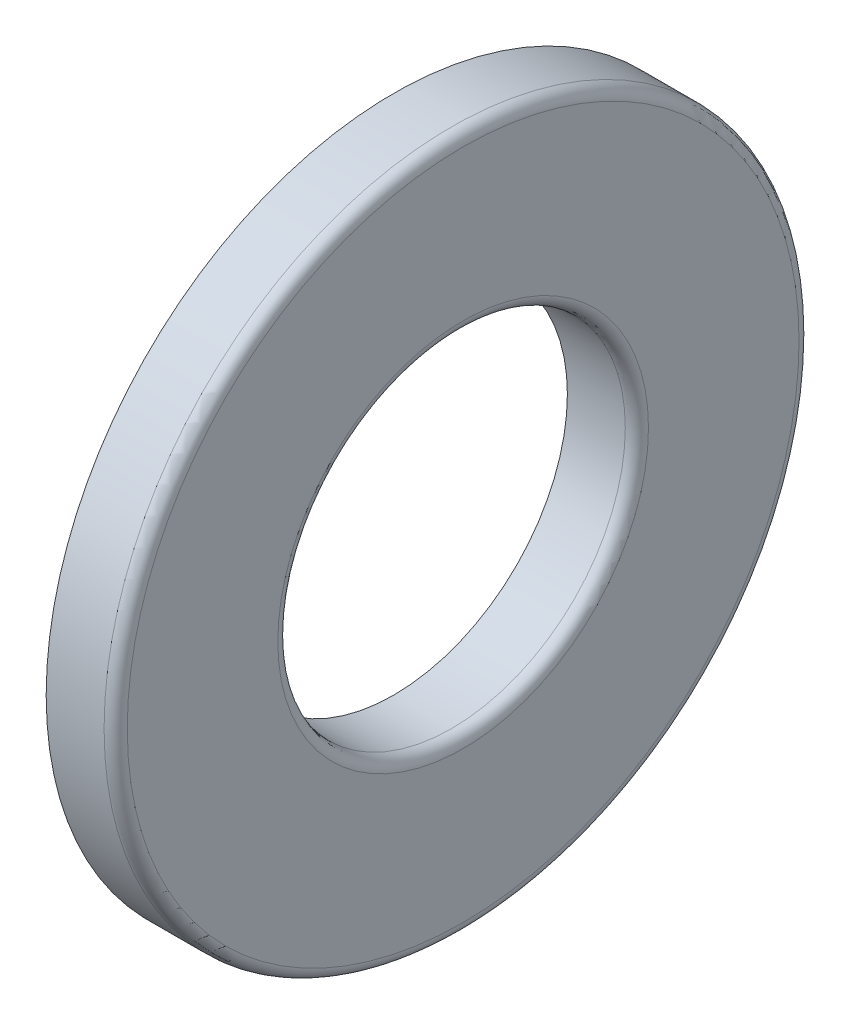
ISO-10303-21;
HEADER;
FILE_DESCRIPTION(('STEP AP214'),'2;1');
FILE_NAME('part.step','',(''),(''),'','','');
FILE_SCHEMA(('AUTOMOTIVE_DESIGN { 1 0 10303 214 1 1 1 1 }'));
ENDSEC;
DATA;
#1=APPLICATION_CONTEXT('core data for automotive mechanical design processes');
#2=APPLICATION_PROTOCOL_DEFINITION('international standard','automotive_design',2000,#1);
#3=PRODUCT_CONTEXT('',#1,'mechanical');
#4=PRODUCT('Part','Part','',(#3));
#5=PRODUCT_RELATED_PRODUCT_CATEGORY('part','',(#4));
#6=PRODUCT_DEFINITION_FORMATION('','',#4);
#7=PRODUCT_DEFINITION_CONTEXT('part definition',#1,'design');
#8=PRODUCT_DEFINITION('design','',#6,#7);
#9=PRODUCT_DEFINITION_SHAPE('','',#8);
#10=(LENGTH_UNIT() NAMED_UNIT(*) SI_UNIT(.MILLI.,.METRE.));
#11=(NAMED_UNIT(*) PLANE_ANGLE_UNIT() SI_UNIT($,.RADIAN.));
#12=(NAMED_UNIT(*) SI_UNIT($,.STERADIAN.) SOLID_ANGLE_UNIT());
#13=UNCERTAINTY_MEASURE_WITH_UNIT(LENGTH_MEASURE(1.E-05),#10,'distance_accuracy_value','');
#14=(GEOMETRIC_REPRESENTATION_CONTEXT(3) GLOBAL_UNCERTAINTY_ASSIGNED_CONTEXT((#13)) GLOBAL_UNIT_ASSIGNED_CONTEXT((#10,
#11,#12)) REPRESENTATION_CONTEXT('',''));
#15=CARTESIAN_POINT('',(0.,0.,0.));
#16=DIRECTION('',(0.,0.,1.));
#17=DIRECTION('',(1.,0.,0.));
#18=AXIS2_PLACEMENT_3D('',#15,#16,#17);
#19=CARTESIAN_POINT('',(10.4999999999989,0.,0.));
#20=DIRECTION('',(1.,0.,0.));
#21=DIRECTION('',(0.,0.,-1.));
#22=AXIS2_PLACEMENT_3D('',#19,#20,#21);
#23=TOROIDAL_SURFACE('',#22,22.5,5.00100000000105);
#24=CARTESIAN_POINT('',(15.,0.,0.));
#25=DIRECTION('',(1.,0.,0.));
#26=DIRECTION('',(0.,0.,-1.));
#27=AXIS2_PLACEMENT_3D('',#24,#25,#26);
#28=CIRCLE('',#27,24.681742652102);
#29=CARTESIAN_POINT('',(15.,0.,-24.681742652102));
#30=VERTEX_POINT('',#29);
#31=EDGE_CURVE('E5',#30,#30,#28,.T.);
#32=ORIENTED_EDGE('',*,*,#31,.F.);
#33=EDGE_LOOP('',(#32));
#34=FACE_BOUND('',#33,.T.);
#35=CARTESIAN_POINT('',(15.,0.,0.));
#36=DIRECTION('',(1.,0.,0.));
#37=DIRECTION('',(0.,0.,-1.));
#38=AXIS2_PLACEMENT_3D('',#35,#36,#37);
#39=CIRCLE('',#38,20.318257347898);
#40=CARTESIAN_POINT('',(15.,0.,-20.318257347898));
#41=VERTEX_POINT('',#40);
#42=EDGE_CURVE('E9',#41,#41,#39,.T.);
#43=ORIENTED_EDGE('',*,*,#42,.T.);
#44=EDGE_LOOP('',(#43));
#45=FACE_BOUND('',#44,.T.);
#46=ADVANCED_FACE('F13',(#34,#45),#23,.F.);
#47=CARTESIAN_POINT('',(15.,30.,0.));
#48=DIRECTION('',(-1.,0.,0.));
#49=DIRECTION('',(0.,0.,1.));
#50=AXIS2_PLACEMENT_3D('',#47,#48,#49);
#51=PLANE('',#50);
#52=ORIENTED_EDGE('',*,*,#31,.T.);
#53=EDGE_LOOP('',(#52));
#54=FACE_BOUND('',#53,.T.);
#55=CARTESIAN_POINT('',(15.,0.,0.));
#56=DIRECTION('',(1.,0.,0.));
#57=DIRECTION('',(0.,0.,-1.));
#58=AXIS2_PLACEMENT_3D('',#55,#56,#57);
#59=CIRCLE('',#58,30.);
#60=CARTESIAN_POINT('',(15.,0.,-30.));
#61=VERTEX_POINT('',#60);
#62=EDGE_CURVE('E26',#61,#61,#59,.T.);
#63=ORIENTED_EDGE('',*,*,#62,.F.);
#64=EDGE_LOOP('',(#63));
#65=FACE_BOUND('',#64,.T.);
#66=ADVANCED_FACE('F30',(#54,#65),#51,.T.);
#67=CARTESIAN_POINT('',(15.,20.318257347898,0.));
#68=DIRECTION('',(-1.,0.,0.));
#69=DIRECTION('',(0.,0.,1.));
#70=AXIS2_PLACEMENT_3D('',#67,#68,#69);
#71=PLANE('',#70);
#72=CARTESIAN_POINT('',(15.,0.,0.));
#73=DIRECTION('',(1.,0.,0.));
#74=DIRECTION('',(0.,0.,-1.));
#75=AXIS2_PLACEMENT_3D('',#72,#73,#74);
#76=CIRCLE('',#75,15.);
#77=CARTESIAN_POINT('',(15.,0.,-15.));
#78=VERTEX_POINT('',#77);
#79=EDGE_CURVE('E37',#78,#78,#76,.T.);
#80=ORIENTED_EDGE('',*,*,#79,.T.);
#81=EDGE_LOOP('',(#80));
#82=FACE_BOUND('',#81,.T.);
#83=ORIENTED_EDGE('',*,*,#42,.F.);
#84=EDGE_LOOP('',(#83));
#85=FACE_BOUND('',#84,.T.);
#86=ADVANCED_FACE('F43',(#82,#85),#71,.T.);
#87=CARTESIAN_POINT('',(21.,0.,0.));
#88=DIRECTION('',(1.,0.,0.));
#89=DIRECTION('',(0.,0.,-1.));
#90=AXIS2_PLACEMENT_3D('',#87,#88,#89);
#91=CYLINDRICAL_SURFACE('',#90,30.);
#92=ORIENTED_EDGE('',*,*,#62,.T.);
#93=EDGE_LOOP('',(#92));
#94=FACE_BOUND('',#93,.T.);
#95=CARTESIAN_POINT('',(20.,0.,0.));
#96=DIRECTION('',(1.,0.,0.));
#97=DIRECTION('',(0.,0.,-1.));
#98=AXIS2_PLACEMENT_3D('',#95,#96,#97);
#99=CIRCLE('',#98,30.);
#100=CARTESIAN_POINT('',(20.,0.,-30.));
#101=VERTEX_POINT('',#100);
#102=EDGE_CURVE('E52',#101,#101,#99,.T.);
#103=ORIENTED_EDGE('',*,*,#102,.F.);
#104=EDGE_LOOP('',(#103));
#105=FACE_BOUND('',#104,.T.);
#106=ADVANCED_FACE('F56',(#94,#105),#91,.T.);
#107=CARTESIAN_POINT('',(21.,0.,0.));
#108=DIRECTION('',(1.,0.,0.));
#109=DIRECTION('',(0.,0.,-1.));
#110=AXIS2_PLACEMENT_3D('',#107,#108,#109);
#111=CYLINDRICAL_SURFACE('',#110,15.);
#112=CARTESIAN_POINT('',(20.,0.,0.));
#113=DIRECTION('',(1.,0.,0.));
#114=DIRECTION('',(0.,0.,-1.));
#115=AXIS2_PLACEMENT_3D('',#112,#113,#114);
#116=CIRCLE('',#115,15.);
#117=CARTESIAN_POINT('',(20.,0.,-15.));
#118=VERTEX_POINT('',#117);
#119=EDGE_CURVE('E63',#118,#118,#116,.T.);
#120=ORIENTED_EDGE('',*,*,#119,.T.);
#121=EDGE_LOOP('',(#120));
#122=FACE_BOUND('',#121,.T.);
#123=ORIENTED_EDGE('',*,*,#79,.F.);
#124=EDGE_LOOP('',(#123));
#125=FACE_BOUND('',#124,.T.);
#126=ADVANCED_FACE('F69',(#122,#125),#111,.F.);
#127=CARTESIAN_POINT('',(20.0000000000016,0.,0.));
#128=DIRECTION('',(1.,0.,0.));
#129=DIRECTION('',(0.,0.,-1.));
#130=AXIS2_PLACEMENT_3D('',#127,#128,#129);
#131=TOROIDAL_SURFACE('',#130,29.0000000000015,0.999999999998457);
#132=ORIENTED_EDGE('',*,*,#102,.T.);
#133=EDGE_LOOP('',(#132));
#134=FACE_BOUND('',#133,.T.);
#135=CARTESIAN_POINT('',(21.,0.,0.));
#136=DIRECTION('',(1.,0.,0.));
#137=DIRECTION('',(0.,0.,-1.));
#138=AXIS2_PLACEMENT_3D('',#135,#136,#137);
#139=CIRCLE('',#138,28.9999998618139);
#140=CARTESIAN_POINT('',(21.,0.,-28.9999998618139));
#141=VERTEX_POINT('',#140);
#142=EDGE_CURVE('E78',#141,#141,#139,.T.);
#143=ORIENTED_EDGE('',*,*,#142,.F.);
#144=EDGE_LOOP('',(#143));
#145=FACE_BOUND('',#144,.T.);
#146=ADVANCED_FACE('F82',(#134,#145),#131,.T.);
#147=CARTESIAN_POINT('',(20.0000000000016,0.,0.));
#148=DIRECTION('',(1.,0.,0.));
#149=DIRECTION('',(0.,0.,-1.));
#150=AXIS2_PLACEMENT_3D('',#147,#148,#149);
#151=TOROIDAL_SURFACE('',#150,15.9999999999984,0.999999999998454);
#152=CARTESIAN_POINT('',(21.,0.,0.));
#153=DIRECTION('',(1.,0.,0.));
#154=DIRECTION('',(0.,0.,-1.));
#155=AXIS2_PLACEMENT_3D('',#152,#153,#154);
#156=CIRCLE('',#155,16.0000001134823);
#157=CARTESIAN_POINT('',(21.,0.,-16.0000001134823));
#158=VERTEX_POINT('',#157);
#159=EDGE_CURVE('E89',#158,#158,#156,.T.);
#160=ORIENTED_EDGE('',*,*,#159,.T.);
#161=EDGE_LOOP('',(#160));
#162=FACE_BOUND('',#161,.T.);
#163=ORIENTED_EDGE('',*,*,#119,.F.);
#164=EDGE_LOOP('',(#163));
#165=FACE_BOUND('',#164,.T.);
#166=ADVANCED_FACE('F95',(#162,#165),#151,.T.);
#167=CARTESIAN_POINT('',(21.,16.,0.));
#168=DIRECTION('',(1.,0.,0.));
#169=DIRECTION('',(0.,0.,-1.));
#170=AXIS2_PLACEMENT_3D('',#167,#168,#169);
#171=PLANE('',#170);
#172=ORIENTED_EDGE('',*,*,#142,.T.);
#173=EDGE_LOOP('',(#172));
#174=FACE_BOUND('',#173,.T.);
#175=ORIENTED_EDGE('',*,*,#159,.F.);
#176=EDGE_LOOP('',(#175));
#177=FACE_BOUND('',#176,.T.);
#178=ADVANCED_FACE('F106',(#174,#177),#171,.T.);
#179=CLOSED_SHELL('',(#46,#66,#86,#106,#126,#146,#166,#178));
#180=MANIFOLD_SOLID_BREP('B1',#179);
#181=ADVANCED_BREP_SHAPE_REPRESENTATION('',(#18,#180),#14);
#182=SHAPE_DEFINITION_REPRESENTATION(#9,#181);
ENDSEC;
END-ISO-10303-21;
